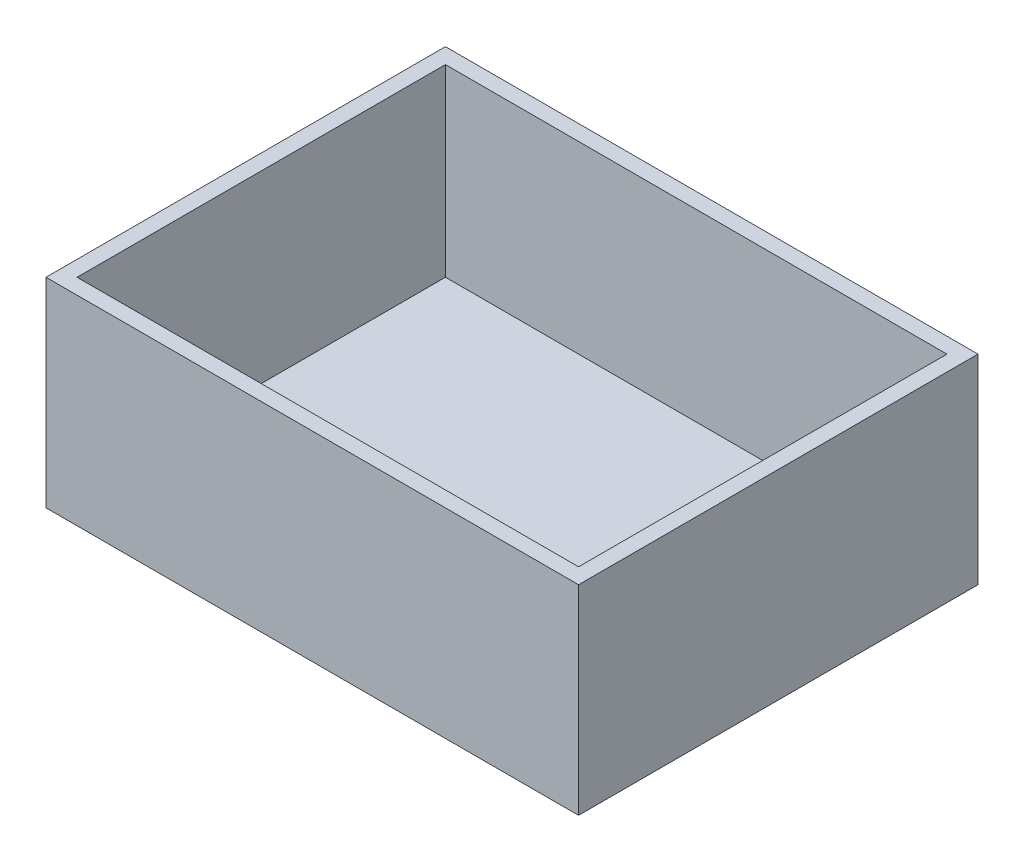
from build123d import *

# Parameters (mm, degrees)
SKETCH_1_W          = 120
SKETCH_1_H          = 90
EXTRUDE_1_DEPTH     = 45
SKETCH_2_W          = 113
SKETCH_2_H          = 83
CUT_EXTRUDE_1_DEPTH = 41.5


with BuildPart() as part:
    # Sketch 1 → Extrude 1 (new body)
    with BuildSketch(Plane(origin=(0, 0, 0), x_dir=(1, 0, 0), z_dir=(0, 1, 0))):
        Rectangle(SKETCH_1_W, SKETCH_1_H)
    extrude(amount=EXTRUDE_1_DEPTH)

    # Sketch 2 → Cut-Extrude 1 (cut)
    with BuildSketch(Plane(origin=(0, 45, 0), x_dir=(1, 0, 0), z_dir=(0, 1, 0))):
        Rectangle(SKETCH_2_W, SKETCH_2_H)
    extrude(amount=-CUT_EXTRUDE_1_DEPTH, mode=Mode.SUBTRACT)


solid = part.part
